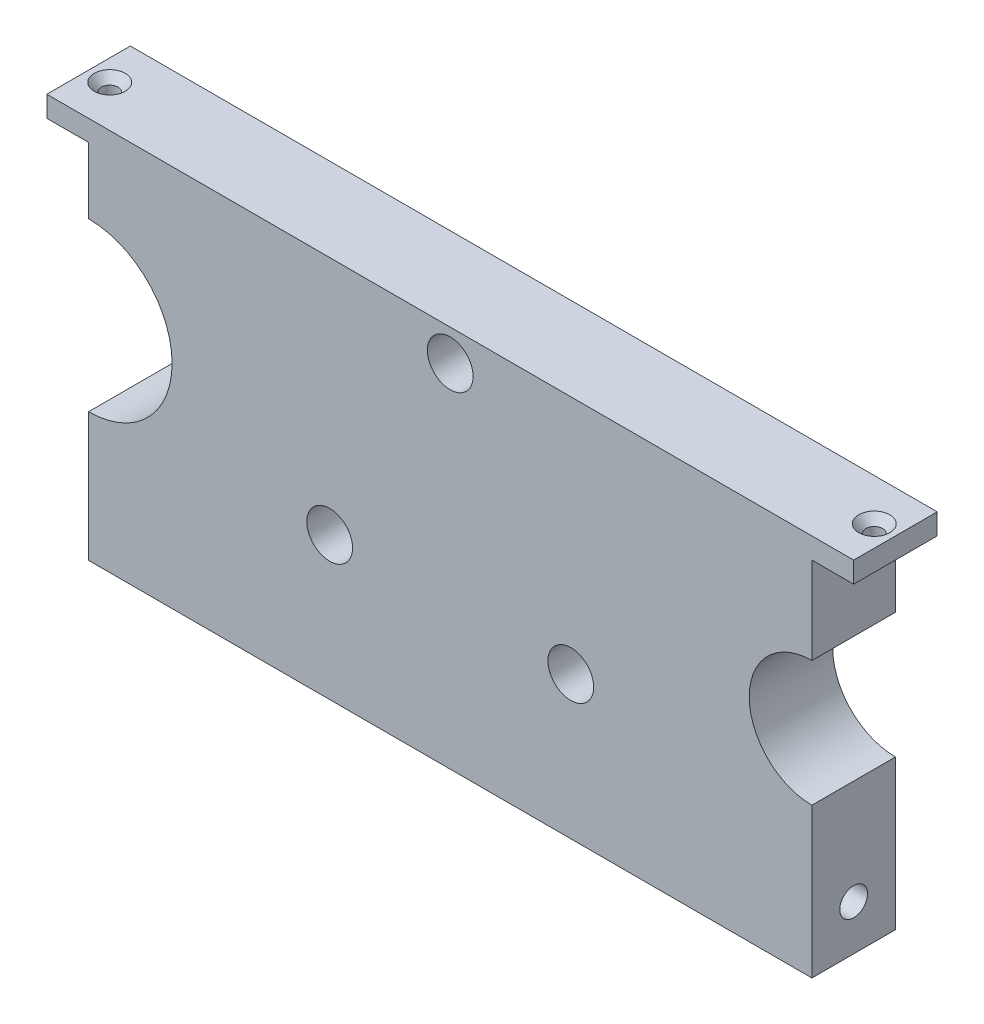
from build123d import *

# Parameters (mm, degrees)
SKETCH1_W                                      = 19.05
SKETCH1_H                                      = 82.55
BOSS_EXTRUDE1_DEPTH                            = 82.4865
CUT_EXTRUDE1_DEPTH                             = 97.120360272
CUT_EXTRUDE1_DEPTH_BACK                        = 97.120360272
SKETCH9_R                                      = 14.2875
SKETCH9_R_2                                    = 19.05
BOSS_EXTRUDE2_DEPTH                            = 9.525
CSK_FOR_10_FLAT_HEAD_SOCKET_CAP_SCR_2_COUNT    = 2
CSK_FOR_10_FLAT_HEAD_SOCKET_CAP_SCR_2_PITCH    = 54.99261314
CSK_FOR_10_FLAT_HEAD_SOCKET_CAP_SCR_3_COUNT    = 2
CSK_FOR_10_FLAT_HEAD_SOCKET_CAP_SCR_3_PITCH    = 54.99261314
CSK_FOR_6_FLAT_HEAD_MACHINE_SCREW1_D           = 3.7973
CSK_FOR_6_FLAT_HEAD_MACHINE_SCREW1_CSINK_D     = 7.0866
CSK_FOR_6_FLAT_HEAD_MACHINE_SCREW1_CSINK_ANGLE = 82


with BuildPart() as part:
    # Sketch1 → Boss-Extrude1 (new, symmetric)
    with BuildSketch(Plane(origin=(0, 0, 0), x_dir=(0, 0, -1), z_dir=(1, 0, 0))):
        with Locations((0, -7.14375)):
            Rectangle(SKETCH1_W, SKETCH1_H)
    extrude(amount=BOSS_EXTRUDE1_DEPTH, both=True)

    # Sketch9 → Cut-Extrude1 (cut, two sides: drawn at the far end of the back side and taken through both)
    with BuildSketch(Plane.XY.offset(-CUT_EXTRUDE1_DEPTH_BACK)):
        with Locations((82.4865, 0)):
            Circle(SKETCH9_R)
        with Locations((-82.4865, 0)):
            Circle(SKETCH9_R_2)
    extrude(amount=CUT_EXTRUDE1_DEPTH + CUT_EXTRUDE1_DEPTH_BACK, mode=Mode.SUBTRACT)

    # Sketch8 → Boss-Extrude2 (add, symmetric)
    with BuildSketch(Plane.XY):
        Polygon((-12.7, 38.89375), (12.7, 38.89375), (82.4865, 38.89375), (92.0115, 38.89375), (92.0115, 34.13125), (82.4865, 34.13125), (-82.4865, 34.13125), (-92.0115, 34.13125), (-92.0115, 38.89375), (-82.4865, 38.89375), align=None)
    extrude(amount=BOSS_EXTRUDE2_DEPTH, both=True)

    # Sketch2 → 1_4 _0.25_ DiaHole _10 Insert (revolve, cut)
    with BuildSketch(Plane(origin=(-82.4865, -38.10635, 0), x_dir=(0, 0, 1), z_dir=(0, 1, 0))):
        Polygon((0, 0), (0, 11.432732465), (3.175, 9.525), (3.175, 0), align=None)
    f_1_4_0_25_diahole_10_insert = revolve(axis=Axis((-88.8365, -38.10635, 0), (1, 0, 0)), mode=Mode.SUBTRACT)

    # Mirror1: 1_4 _0.25_ DiaHole _10 Insert across plane
    add(f_1_4_0_25_diahole_10_insert.mirror(Plane(origin=(0, 0, 0), x_dir=(0, 0, 1), z_dir=(1, 0, 0))), mode=Mode.SUBTRACT)

    # Sketch6 → CSK for _10 Flat Head Socket Cap Screw3 (revolve, cut)
    with BuildSketch(Plane(origin=(0, 31.75, 9.525), x_dir=(0, -1, 0), z_dir=(1, 0, 0))):
        Polygon((0, 0), (0, 19.05), (2.5527, 19.05), (2.5527, 15.768032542), (5.2197, 12.7), (5.2197, 0), align=None)
    csk_for_10_flat_head_socket_cap_screw3 = revolve(axis=Axis((0, 31.75, 15.875), (0, 0, -1)), mode=Mode.SUBTRACT)

    # CSK for _10 Flat Head Socket Cap Scr 2: CSK for _10 Flat Head Socket Cap Screw3 ×2
    with Locations(*[Vector(0.49999999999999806, -0.8660254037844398, 0) * (i * CSK_FOR_10_FLAT_HEAD_SOCKET_CAP_SCR_2_PITCH) for i in range(1, CSK_FOR_10_FLAT_HEAD_SOCKET_CAP_SCR_2_COUNT)]):
        add(csk_for_10_flat_head_socket_cap_screw3, mode=Mode.SUBTRACT)

    # CSK for _10 Flat Head Socket Cap Scr 3: CSK for _10 Flat Head Socket Cap Screw3 ×2
    with Locations(*[Vector(-0.4999999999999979, -0.8660254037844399, 0) * (i * CSK_FOR_10_FLAT_HEAD_SOCKET_CAP_SCR_3_PITCH) for i in range(1, CSK_FOR_10_FLAT_HEAD_SOCKET_CAP_SCR_3_COUNT)]):
        add(csk_for_10_flat_head_socket_cap_screw3, mode=Mode.SUBTRACT)

    # CSK for _6 Flat Head Machine Screw1 (through all)
    with Locations(Plane(origin=(0, 38.89375, 0), x_dir=(1, 0, 0), z_dir=(0, 1, 0))):
        with Locations((-87.1855, 0), (87.1855, 0)):
            CounterSinkHole(CSK_FOR_6_FLAT_HEAD_MACHINE_SCREW1_D / 2, CSK_FOR_6_FLAT_HEAD_MACHINE_SCREW1_CSINK_D / 2, counter_sink_angle=CSK_FOR_6_FLAT_HEAD_MACHINE_SCREW1_CSINK_ANGLE)


solid = part.part
